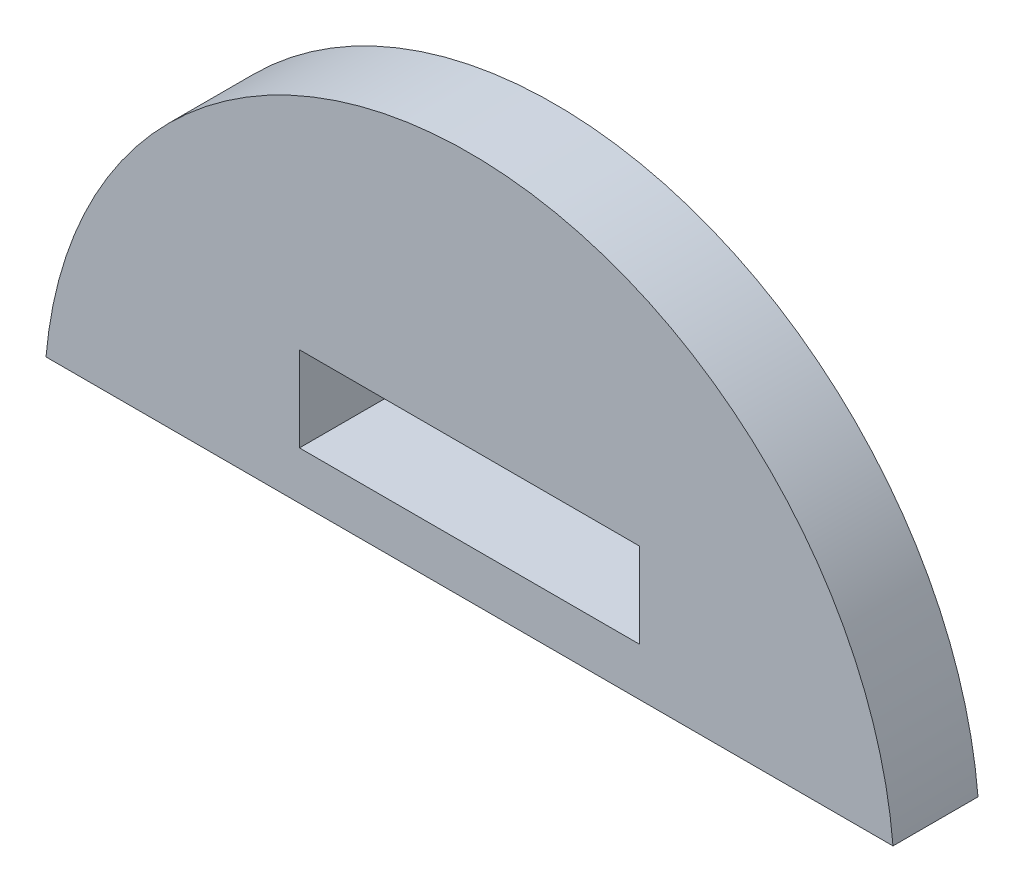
ISO-10303-21;
HEADER;
FILE_DESCRIPTION(('STEP AP214'),'2;1');
FILE_NAME('part.step','',(''),(''),'','','');
FILE_SCHEMA(('AUTOMOTIVE_DESIGN { 1 0 10303 214 1 1 1 1 }'));
ENDSEC;
DATA;
#1=APPLICATION_CONTEXT('core data for automotive mechanical design processes');
#2=APPLICATION_PROTOCOL_DEFINITION('international standard','automotive_design',2000,#1);
#3=PRODUCT_CONTEXT('',#1,'mechanical');
#4=PRODUCT('Part','Part','',(#3));
#5=PRODUCT_RELATED_PRODUCT_CATEGORY('part','',(#4));
#6=PRODUCT_DEFINITION_FORMATION('','',#4);
#7=PRODUCT_DEFINITION_CONTEXT('part definition',#1,'design');
#8=PRODUCT_DEFINITION('design','',#6,#7);
#9=PRODUCT_DEFINITION_SHAPE('','',#8);
#10=(LENGTH_UNIT() NAMED_UNIT(*) SI_UNIT(.MILLI.,.METRE.));
#11=(NAMED_UNIT(*) PLANE_ANGLE_UNIT() SI_UNIT($,.RADIAN.));
#12=(NAMED_UNIT(*) SI_UNIT($,.STERADIAN.) SOLID_ANGLE_UNIT());
#13=UNCERTAINTY_MEASURE_WITH_UNIT(LENGTH_MEASURE(1.E-05),#10,'distance_accuracy_value','');
#14=(GEOMETRIC_REPRESENTATION_CONTEXT(3) GLOBAL_UNCERTAINTY_ASSIGNED_CONTEXT((#13)) GLOBAL_UNIT_ASSIGNED_CONTEXT((#10,
#11,#12)) REPRESENTATION_CONTEXT('',''));
#15=CARTESIAN_POINT('',(0.,0.,0.));
#16=DIRECTION('',(0.,0.,1.));
#17=DIRECTION('',(1.,0.,0.));
#18=AXIS2_PLACEMENT_3D('',#15,#16,#17);
#19=CARTESIAN_POINT('',(49.4622336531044,-2.60467587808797,3.81));
#20=DIRECTION('',(0.,0.,1.));
#21=DIRECTION('',(1.,0.,0.));
#22=AXIS2_PLACEMENT_3D('',#19,#20,#21);
#23=PLANE('',#22);
#24=CARTESIAN_POINT('',(49.4622336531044,-2.60467587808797,3.81));
#25=DIRECTION('',(0.,0.,1.));
#26=DIRECTION('',(1.,0.,0.));
#27=AXIS2_PLACEMENT_3D('',#24,#25,#26);
#28=CIRCLE('',#27,19.05);
#29=CARTESIAN_POINT('',(68.4414846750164,-0.964392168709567,3.81));
#30=VERTEX_POINT('',#29);
#31=CARTESIAN_POINT('',(30.4829826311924,-0.964392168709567,3.81));
#32=VERTEX_POINT('',#31);
#33=EDGE_CURVE('E124',#30,#32,#28,.T.);
#34=ORIENTED_EDGE('',*,*,#33,.T.);
#35=DIRECTION('',(1.,0.,0.));
#36=VECTOR('',#35,1.);
#37=CARTESIAN_POINT('',(30.4829826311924,-0.964392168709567,3.81));
#38=LINE('',#37,#36);
#39=EDGE_CURVE('E127',#32,#30,#38,.T.);
#40=ORIENTED_EDGE('',*,*,#39,.T.);
#41=EDGE_LOOP('',(#34,#40));
#42=FACE_BOUND('',#41,.T.);
#43=DIRECTION('',(1.,0.,0.));
#44=VECTOR('',#43,1.);
#45=CARTESIAN_POINT('',(41.8422336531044,1.18413388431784,3.81));
#46=LINE('',#45,#44);
#47=CARTESIAN_POINT('',(41.8422336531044,1.18413388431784,3.81));
#48=VERTEX_POINT('',#47);
#49=CARTESIAN_POINT('',(57.0822336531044,1.18413388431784,3.81));
#50=VERTEX_POINT('',#49);
#51=EDGE_CURVE('E110',#48,#50,#46,.T.);
#52=ORIENTED_EDGE('',*,*,#51,.F.);
#53=DIRECTION('',(0.,-1.,0.));
#54=VECTOR('',#53,1.);
#55=CARTESIAN_POINT('',(41.8422336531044,4.99413388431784,3.81));
#56=LINE('',#55,#54);
#57=CARTESIAN_POINT('',(41.8422336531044,4.99413388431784,3.81));
#58=VERTEX_POINT('',#57);
#59=EDGE_CURVE('E99',#58,#48,#56,.T.);
#60=ORIENTED_EDGE('',*,*,#59,.F.);
#61=DIRECTION('',(-1.,0.,0.));
#62=VECTOR('',#61,1.);
#63=CARTESIAN_POINT('',(41.8422336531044,4.99413388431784,3.81));
#64=LINE('',#63,#62);
#65=CARTESIAN_POINT('',(57.0822336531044,4.99413388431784,3.81));
#66=VERTEX_POINT('',#65);
#67=EDGE_CURVE('E114',#66,#58,#64,.T.);
#68=ORIENTED_EDGE('',*,*,#67,.F.);
#69=DIRECTION('',(0.,1.,0.));
#70=VECTOR('',#69,1.);
#71=CARTESIAN_POINT('',(57.0822336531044,4.99413388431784,3.81));
#72=LINE('',#71,#70);
#73=EDGE_CURVE('E112',#50,#66,#72,.T.);
#74=ORIENTED_EDGE('',*,*,#73,.F.);
#75=EDGE_LOOP('',(#52,#60,#68,#74));
#76=FACE_BOUND('',#75,.T.);
#77=ADVANCED_FACE('F31',(#42,#76),#23,.T.);
#78=CARTESIAN_POINT('',(49.4622336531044,-2.60467587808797,0.));
#79=DIRECTION('',(0.,0.,1.));
#80=DIRECTION('',(1.,0.,0.));
#81=AXIS2_PLACEMENT_3D('',#78,#79,#80);
#82=PLANE('',#81);
#83=CARTESIAN_POINT('',(49.4622336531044,-2.60467587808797,0.));
#84=DIRECTION('',(0.,0.,1.));
#85=DIRECTION('',(1.,0.,0.));
#86=AXIS2_PLACEMENT_3D('',#83,#84,#85);
#87=CIRCLE('',#86,19.05);
#88=CARTESIAN_POINT('',(68.4414846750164,-0.964392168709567,0.));
#89=VERTEX_POINT('',#88);
#90=CARTESIAN_POINT('',(30.4829826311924,-0.964392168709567,0.));
#91=VERTEX_POINT('',#90);
#92=EDGE_CURVE('E100',#89,#91,#87,.T.);
#93=ORIENTED_EDGE('',*,*,#92,.F.);
#94=DIRECTION('',(1.,0.,0.));
#95=VECTOR('',#94,1.);
#96=CARTESIAN_POINT('',(30.4829826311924,-0.964392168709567,0.));
#97=LINE('',#96,#95);
#98=EDGE_CURVE('E122',#91,#89,#97,.T.);
#99=ORIENTED_EDGE('',*,*,#98,.F.);
#100=EDGE_LOOP('',(#93,#99));
#101=FACE_BOUND('',#100,.T.);
#102=DIRECTION('',(0.,-1.,0.));
#103=VECTOR('',#102,1.);
#104=CARTESIAN_POINT('',(41.8422336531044,4.99413388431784,0.));
#105=LINE('',#104,#103);
#106=CARTESIAN_POINT('',(41.8422336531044,4.99413388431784,0.));
#107=VERTEX_POINT('',#106);
#108=CARTESIAN_POINT('',(41.8422336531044,1.18413388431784,0.));
#109=VERTEX_POINT('',#108);
#110=EDGE_CURVE('E54',#107,#109,#105,.T.);
#111=ORIENTED_EDGE('',*,*,#110,.T.);
#112=DIRECTION('',(1.,0.,0.));
#113=VECTOR('',#112,1.);
#114=CARTESIAN_POINT('',(41.8422336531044,1.18413388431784,0.));
#115=LINE('',#114,#113);
#116=CARTESIAN_POINT('',(57.0822336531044,1.18413388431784,0.));
#117=VERTEX_POINT('',#116);
#118=EDGE_CURVE('E86',#109,#117,#115,.T.);
#119=ORIENTED_EDGE('',*,*,#118,.T.);
#120=DIRECTION('',(0.,1.,0.));
#121=VECTOR('',#120,1.);
#122=CARTESIAN_POINT('',(57.0822336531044,4.99413388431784,0.));
#123=LINE('',#122,#121);
#124=CARTESIAN_POINT('',(57.0822336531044,4.99413388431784,0.));
#125=VERTEX_POINT('',#124);
#126=EDGE_CURVE('E95',#117,#125,#123,.T.);
#127=ORIENTED_EDGE('',*,*,#126,.T.);
#128=DIRECTION('',(-1.,0.,0.));
#129=VECTOR('',#128,1.);
#130=CARTESIAN_POINT('',(41.8422336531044,4.99413388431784,0.));
#131=LINE('',#130,#129);
#132=EDGE_CURVE('E104',#125,#107,#131,.T.);
#133=ORIENTED_EDGE('',*,*,#132,.T.);
#134=EDGE_LOOP('',(#111,#119,#127,#133));
#135=FACE_BOUND('',#134,.T.);
#136=ADVANCED_FACE('F103',(#101,#135),#82,.F.);
#137=CARTESIAN_POINT('',(49.4622336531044,-2.60467587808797,3.81));
#138=DIRECTION('',(0.,0.,-1.));
#139=DIRECTION('',(-1.,0.,0.));
#140=AXIS2_PLACEMENT_3D('',#137,#138,#139);
#141=CYLINDRICAL_SURFACE('',#140,19.05);
#142=ORIENTED_EDGE('',*,*,#92,.T.);
#143=DIRECTION('',(0.,0.,-1.));
#144=VECTOR('',#143,1.);
#145=CARTESIAN_POINT('',(30.4829826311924,-0.964392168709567,3.81));
#146=LINE('',#145,#144);
#147=EDGE_CURVE('E11',#32,#91,#146,.T.);
#148=ORIENTED_EDGE('',*,*,#147,.F.);
#149=ORIENTED_EDGE('',*,*,#33,.F.);
#150=DIRECTION('',(0.,0.,-1.));
#151=VECTOR('',#150,1.);
#152=CARTESIAN_POINT('',(68.4414846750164,-0.964392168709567,3.81));
#153=LINE('',#152,#151);
#154=EDGE_CURVE('E39',#30,#89,#153,.T.);
#155=ORIENTED_EDGE('',*,*,#154,.T.);
#156=EDGE_LOOP('',(#142,#148,#149,#155));
#157=FACE_BOUND('',#156,.T.);
#158=ADVANCED_FACE('F33',(#157),#141,.T.);
#159=CARTESIAN_POINT('',(30.4829826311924,-0.964392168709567,3.81));
#160=DIRECTION('',(0.,1.,0.));
#161=DIRECTION('',(0.,0.,1.));
#162=AXIS2_PLACEMENT_3D('',#159,#160,#161);
#163=PLANE('',#162);
#164=ORIENTED_EDGE('',*,*,#98,.T.);
#165=ORIENTED_EDGE('',*,*,#154,.F.);
#166=ORIENTED_EDGE('',*,*,#39,.F.);
#167=ORIENTED_EDGE('',*,*,#147,.T.);
#168=EDGE_LOOP('',(#164,#165,#166,#167));
#169=FACE_BOUND('',#168,.T.);
#170=ADVANCED_FACE('F136',(#169),#163,.F.);
#171=CARTESIAN_POINT('',(41.8422336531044,4.99413388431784,3.81));
#172=DIRECTION('',(1.,0.,0.));
#173=DIRECTION('',(0.,0.,-1.));
#174=AXIS2_PLACEMENT_3D('',#171,#172,#173);
#175=PLANE('',#174);
#176=ORIENTED_EDGE('',*,*,#110,.F.);
#177=DIRECTION('',(0.,0.,-1.));
#178=VECTOR('',#177,1.);
#179=CARTESIAN_POINT('',(41.8422336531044,4.99413388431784,3.81));
#180=LINE('',#179,#178);
#181=EDGE_CURVE('E116',#58,#107,#180,.T.);
#182=ORIENTED_EDGE('',*,*,#181,.F.);
#183=ORIENTED_EDGE('',*,*,#59,.T.);
#184=DIRECTION('',(0.,0.,-1.));
#185=VECTOR('',#184,1.);
#186=CARTESIAN_POINT('',(41.8422336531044,1.18413388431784,3.81));
#187=LINE('',#186,#185);
#188=EDGE_CURVE('E88',#48,#109,#187,.T.);
#189=ORIENTED_EDGE('',*,*,#188,.T.);
#190=EDGE_LOOP('',(#176,#182,#183,#189));
#191=FACE_BOUND('',#190,.T.);
#192=ADVANCED_FACE('F97',(#191),#175,.T.);
#193=CARTESIAN_POINT('',(41.8422336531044,1.18413388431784,3.81));
#194=DIRECTION('',(0.,1.,0.));
#195=DIRECTION('',(0.,0.,1.));
#196=AXIS2_PLACEMENT_3D('',#193,#194,#195);
#197=PLANE('',#196);
#198=ORIENTED_EDGE('',*,*,#118,.F.);
#199=ORIENTED_EDGE('',*,*,#188,.F.);
#200=ORIENTED_EDGE('',*,*,#51,.T.);
#201=DIRECTION('',(0.,0.,-1.));
#202=VECTOR('',#201,1.);
#203=CARTESIAN_POINT('',(57.0822336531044,1.18413388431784,3.81));
#204=LINE('',#203,#202);
#205=EDGE_CURVE('E91',#50,#117,#204,.T.);
#206=ORIENTED_EDGE('',*,*,#205,.T.);
#207=EDGE_LOOP('',(#198,#199,#200,#206));
#208=FACE_BOUND('',#207,.T.);
#209=ADVANCED_FACE('F87',(#208),#197,.T.);
#210=CARTESIAN_POINT('',(57.0822336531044,4.99413388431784,3.81));
#211=DIRECTION('',(-1.,0.,0.));
#212=DIRECTION('',(0.,0.,1.));
#213=AXIS2_PLACEMENT_3D('',#210,#211,#212);
#214=PLANE('',#213);
#215=ORIENTED_EDGE('',*,*,#126,.F.);
#216=ORIENTED_EDGE('',*,*,#205,.F.);
#217=ORIENTED_EDGE('',*,*,#73,.T.);
#218=DIRECTION('',(0.,0.,-1.));
#219=VECTOR('',#218,1.);
#220=CARTESIAN_POINT('',(57.0822336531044,4.99413388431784,3.81));
#221=LINE('',#220,#219);
#222=EDGE_CURVE('E46',#66,#125,#221,.T.);
#223=ORIENTED_EDGE('',*,*,#222,.T.);
#224=EDGE_LOOP('',(#215,#216,#217,#223));
#225=FACE_BOUND('',#224,.T.);
#226=ADVANCED_FACE('F144',(#225),#214,.T.);
#227=CARTESIAN_POINT('',(41.8422336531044,4.99413388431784,3.81));
#228=DIRECTION('',(0.,-1.,0.));
#229=DIRECTION('',(0.,0.,-1.));
#230=AXIS2_PLACEMENT_3D('',#227,#228,#229);
#231=PLANE('',#230);
#232=ORIENTED_EDGE('',*,*,#132,.F.);
#233=ORIENTED_EDGE('',*,*,#222,.F.);
#234=ORIENTED_EDGE('',*,*,#67,.T.);
#235=ORIENTED_EDGE('',*,*,#181,.T.);
#236=EDGE_LOOP('',(#232,#233,#234,#235));
#237=FACE_BOUND('',#236,.T.);
#238=ADVANCED_FACE('F145',(#237),#231,.T.);
#239=CLOSED_SHELL('',(#77,#136,#158,#170,#192,#209,#226,#238));
#240=MANIFOLD_SOLID_BREP('B2',#239);
#241=ADVANCED_BREP_SHAPE_REPRESENTATION('',(#18,#240),#14);
#242=SHAPE_DEFINITION_REPRESENTATION(#9,#241);
ENDSEC;
END-ISO-10303-21;
